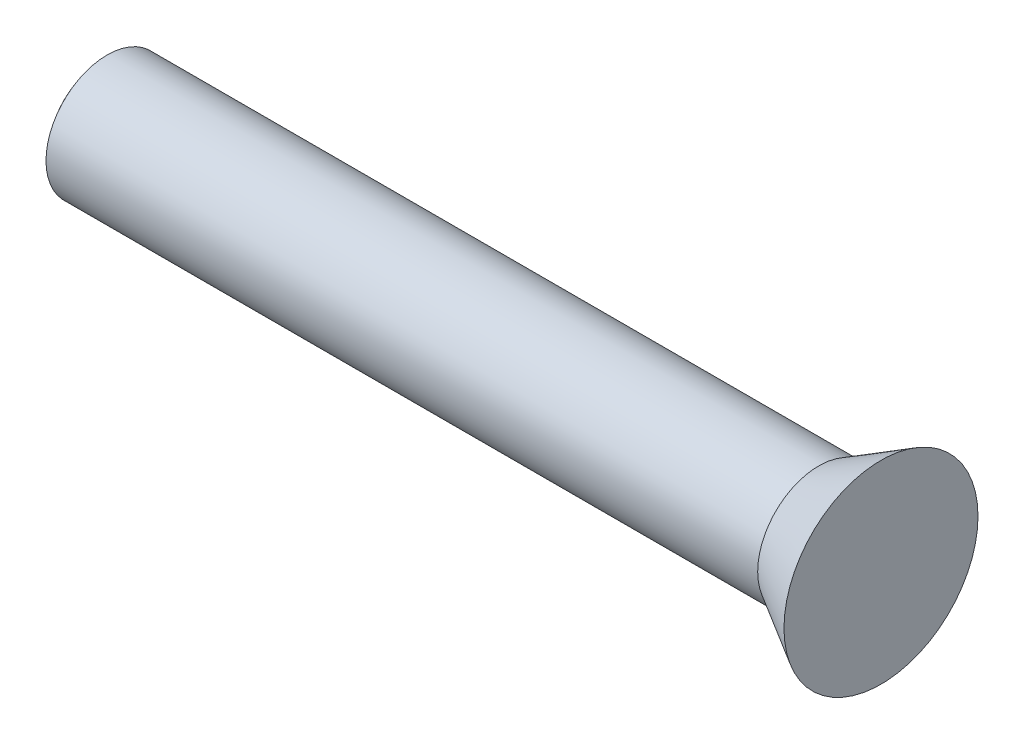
from build123d import *


with BuildPart() as part:
    # Sketch1 → Revolve1 (revolve)
    with BuildSketch(Plane.XY, mode=Mode.PRIVATE) as revolve1_sk:
        with BuildLine():
            Line((-0.986275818, 0.8001), (8.330109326, 0.8001))
            Line((8.330109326, 0.8001), (9.144, 1.27))
            Line((9.144, 1.27), (9.144, 0))
            Line((9.144, 0), (-1.27, 0))
            ThreePointArc((-1.27, 0), (-1.196969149, 0.424458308), (-0.986275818, 0.8001))
        make_face()
    revolve(revolve1_sk.sketch.rotate(Axis((19.688578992, 0, 0), (1, 0, 0)), 90), axis=Axis((19.688578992, 0, 0), (1, 0, 0)))


solid = part.part
